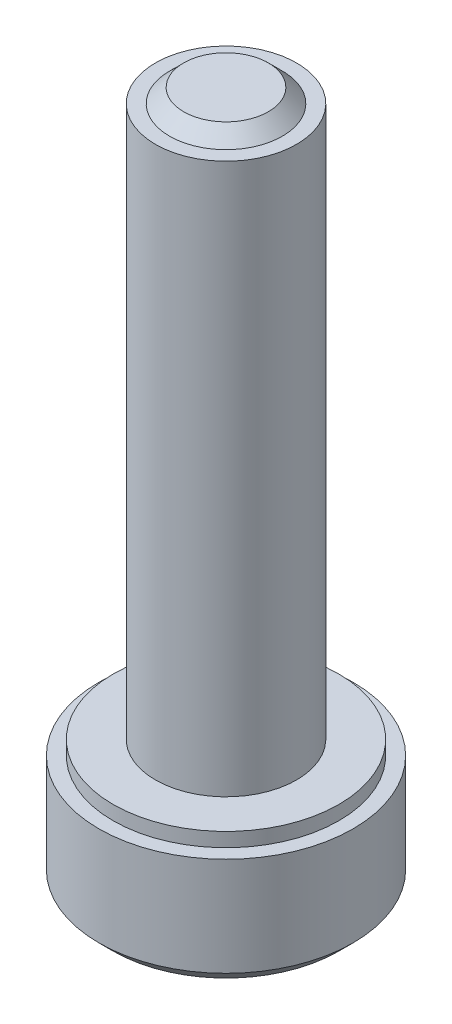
ISO-10303-21;
HEADER;
FILE_DESCRIPTION(('STEP AP214'),'2;1');
FILE_NAME('part.step','',(''),(''),'','','');
FILE_SCHEMA(('AUTOMOTIVE_DESIGN { 1 0 10303 214 1 1 1 1 }'));
ENDSEC;
DATA;
#1=APPLICATION_CONTEXT('core data for automotive mechanical design processes');
#2=APPLICATION_PROTOCOL_DEFINITION('international standard','automotive_design',2000,#1);
#3=PRODUCT_CONTEXT('',#1,'mechanical');
#4=PRODUCT('Part','Part','',(#3));
#5=PRODUCT_RELATED_PRODUCT_CATEGORY('part','',(#4));
#6=PRODUCT_DEFINITION_FORMATION('','',#4);
#7=PRODUCT_DEFINITION_CONTEXT('part definition',#1,'design');
#8=PRODUCT_DEFINITION('design','',#6,#7);
#9=PRODUCT_DEFINITION_SHAPE('','',#8);
#10=(LENGTH_UNIT() NAMED_UNIT(*) SI_UNIT(.MILLI.,.METRE.));
#11=(NAMED_UNIT(*) PLANE_ANGLE_UNIT() SI_UNIT($,.RADIAN.));
#12=(NAMED_UNIT(*) SI_UNIT($,.STERADIAN.) SOLID_ANGLE_UNIT());
#13=UNCERTAINTY_MEASURE_WITH_UNIT(LENGTH_MEASURE(1.E-05),#10,'distance_accuracy_value','');
#14=(GEOMETRIC_REPRESENTATION_CONTEXT(3) GLOBAL_UNCERTAINTY_ASSIGNED_CONTEXT((#13)) GLOBAL_UNIT_ASSIGNED_CONTEXT((#10,
#11,#12)) REPRESENTATION_CONTEXT('',''));
#15=CARTESIAN_POINT('',(0.,0.,0.));
#16=DIRECTION('',(0.,0.,1.));
#17=DIRECTION('',(1.,0.,0.));
#18=AXIS2_PLACEMENT_3D('',#15,#16,#17);
#19=CARTESIAN_POINT('',(0.,8.,0.));
#20=DIRECTION('',(0.,-1.,0.));
#21=DIRECTION('',(0.,0.,-1.));
#22=AXIS2_PLACEMENT_3D('',#19,#20,#21);
#23=CYLINDRICAL_SURFACE('',#22,9.);
#24=CARTESIAN_POINT('',(0.,1.,0.));
#25=DIRECTION('',(0.,1.,0.));
#26=DIRECTION('',(0.,0.,1.));
#27=AXIS2_PLACEMENT_3D('',#24,#25,#26);
#28=CIRCLE('',#27,9.);
#29=CARTESIAN_POINT('',(0.,1.,9.));
#30=VERTEX_POINT('',#29);
#31=EDGE_CURVE('E50',#30,#30,#28,.T.);
#32=ORIENTED_EDGE('',*,*,#31,.T.);
#33=EDGE_LOOP('',(#32));
#34=FACE_BOUND('',#33,.T.);
#35=CARTESIAN_POINT('',(0.,8.,0.));
#36=DIRECTION('',(0.,1.,0.));
#37=DIRECTION('',(0.,0.,1.));
#38=AXIS2_PLACEMENT_3D('',#35,#36,#37);
#39=CIRCLE('',#38,9.);
#40=CARTESIAN_POINT('',(0.,8.,9.));
#41=VERTEX_POINT('',#40);
#42=EDGE_CURVE('E61',#41,#41,#39,.T.);
#43=ORIENTED_EDGE('',*,*,#42,.F.);
#44=EDGE_LOOP('',(#43));
#45=FACE_BOUND('',#44,.T.);
#46=ADVANCED_FACE('F42',(#34,#45),#23,.T.);
#47=CARTESIAN_POINT('',(0.,8.,0.));
#48=DIRECTION('',(0.,1.,0.));
#49=DIRECTION('',(0.,0.,1.));
#50=AXIS2_PLACEMENT_3D('',#47,#48,#49);
#51=PLANE('',#50);
#52=CARTESIAN_POINT('',(0.,8.,0.));
#53=DIRECTION('',(0.,1.,0.));
#54=DIRECTION('',(0.,0.,1.));
#55=AXIS2_PLACEMENT_3D('',#52,#53,#54);
#56=CIRCLE('',#55,8.);
#57=CARTESIAN_POINT('',(0.,8.,8.));
#58=VERTEX_POINT('',#57);
#59=EDGE_CURVE('E64',#58,#58,#56,.T.);
#60=ORIENTED_EDGE('',*,*,#59,.F.);
#61=EDGE_LOOP('',(#60));
#62=FACE_BOUND('',#61,.T.);
#63=ORIENTED_EDGE('',*,*,#42,.T.);
#64=EDGE_LOOP('',(#63));
#65=FACE_BOUND('',#64,.T.);
#66=ADVANCED_FACE('F108',(#62,#65),#51,.T.);
#67=CARTESIAN_POINT('',(0.,0.,0.));
#68=DIRECTION('',(0.,1.,0.));
#69=DIRECTION('',(0.,0.,1.));
#70=AXIS2_PLACEMENT_3D('',#67,#68,#69);
#71=PLANE('',#70);
#72=CARTESIAN_POINT('',(0.,0.,0.));
#73=DIRECTION('',(0.,1.,0.));
#74=DIRECTION('',(0.,0.,1.));
#75=AXIS2_PLACEMENT_3D('',#72,#73,#74);
#76=CIRCLE('',#75,8.);
#77=CARTESIAN_POINT('',(0.,0.,8.));
#78=VERTEX_POINT('',#77);
#79=EDGE_CURVE('E10',#78,#78,#76,.F.);
#80=ORIENTED_EDGE('',*,*,#79,.T.);
#81=EDGE_LOOP('',(#80));
#82=FACE_BOUND('',#81,.T.);
#83=ADVANCED_FACE('F104',(#82),#71,.F.);
#84=CARTESIAN_POINT('',(0.,9.,0.));
#85=DIRECTION('',(0.,-1.,0.));
#86=DIRECTION('',(0.,0.,-1.));
#87=AXIS2_PLACEMENT_3D('',#84,#85,#86);
#88=CYLINDRICAL_SURFACE('',#87,8.);
#89=CARTESIAN_POINT('',(0.,9.,0.));
#90=DIRECTION('',(0.,1.,0.));
#91=DIRECTION('',(0.,0.,1.));
#92=AXIS2_PLACEMENT_3D('',#89,#90,#91);
#93=CIRCLE('',#92,8.);
#94=CARTESIAN_POINT('',(0.,9.,8.));
#95=VERTEX_POINT('',#94);
#96=EDGE_CURVE('E65',#95,#95,#93,.T.);
#97=ORIENTED_EDGE('',*,*,#96,.F.);
#98=EDGE_LOOP('',(#97));
#99=FACE_BOUND('',#98,.T.);
#100=ORIENTED_EDGE('',*,*,#59,.T.);
#101=EDGE_LOOP('',(#100));
#102=FACE_BOUND('',#101,.T.);
#103=ADVANCED_FACE('F98',(#99,#102),#88,.T.);
#104=CARTESIAN_POINT('',(0.,9.,0.));
#105=DIRECTION('',(0.,1.,0.));
#106=DIRECTION('',(0.,0.,1.));
#107=AXIS2_PLACEMENT_3D('',#104,#105,#106);
#108=PLANE('',#107);
#109=CARTESIAN_POINT('',(0.,9.,0.));
#110=DIRECTION('',(0.,1.,0.));
#111=DIRECTION('',(0.,0.,1.));
#112=AXIS2_PLACEMENT_3D('',#109,#110,#111);
#113=CIRCLE('',#112,5.);
#114=CARTESIAN_POINT('',(0.,9.,5.));
#115=VERTEX_POINT('',#114);
#116=EDGE_CURVE('E68',#115,#115,#113,.T.);
#117=ORIENTED_EDGE('',*,*,#116,.F.);
#118=EDGE_LOOP('',(#117));
#119=FACE_BOUND('',#118,.T.);
#120=ORIENTED_EDGE('',*,*,#96,.T.);
#121=EDGE_LOOP('',(#120));
#122=FACE_BOUND('',#121,.T.);
#123=ADVANCED_FACE('F92',(#119,#122),#108,.T.);
#124=CARTESIAN_POINT('',(0.,48.,0.));
#125=DIRECTION('',(0.,-1.,0.));
#126=DIRECTION('',(0.,0.,-1.));
#127=AXIS2_PLACEMENT_3D('',#124,#125,#126);
#128=CYLINDRICAL_SURFACE('',#127,5.);
#129=CARTESIAN_POINT('',(0.,48.,0.));
#130=DIRECTION('',(0.,1.,0.));
#131=DIRECTION('',(0.,0.,1.));
#132=AXIS2_PLACEMENT_3D('',#129,#130,#131);
#133=CIRCLE('',#132,5.);
#134=CARTESIAN_POINT('',(0.,48.,5.));
#135=VERTEX_POINT('',#134);
#136=EDGE_CURVE('E71',#135,#135,#133,.T.);
#137=ORIENTED_EDGE('',*,*,#136,.F.);
#138=EDGE_LOOP('',(#137));
#139=FACE_BOUND('',#138,.T.);
#140=ORIENTED_EDGE('',*,*,#116,.T.);
#141=EDGE_LOOP('',(#140));
#142=FACE_BOUND('',#141,.T.);
#143=ADVANCED_FACE('F86',(#139,#142),#128,.T.);
#144=CARTESIAN_POINT('',(0.,48.,0.));
#145=DIRECTION('',(0.,1.,0.));
#146=DIRECTION('',(0.,0.,1.));
#147=AXIS2_PLACEMENT_3D('',#144,#145,#146);
#148=PLANE('',#147);
#149=CARTESIAN_POINT('',(0.,48.,0.));
#150=DIRECTION('',(0.,1.,0.));
#151=DIRECTION('',(0.,0.,1.));
#152=AXIS2_PLACEMENT_3D('',#149,#150,#151);
#153=CIRCLE('',#152,4.);
#154=CARTESIAN_POINT('',(0.,48.,4.));
#155=VERTEX_POINT('',#154);
#156=EDGE_CURVE('E58',#155,#155,#153,.T.);
#157=ORIENTED_EDGE('',*,*,#156,.F.);
#158=EDGE_LOOP('',(#157));
#159=FACE_BOUND('',#158,.T.);
#160=ORIENTED_EDGE('',*,*,#136,.T.);
#161=EDGE_LOOP('',(#160));
#162=FACE_BOUND('',#161,.T.);
#163=ADVANCED_FACE('F82',(#159,#162),#148,.T.);
#164=CARTESIAN_POINT('',(0.,49.,0.));
#165=DIRECTION('',(0.,1.,0.));
#166=DIRECTION('',(0.,0.,1.));
#167=AXIS2_PLACEMENT_3D('',#164,#165,#166);
#168=PLANE('',#167);
#169=CARTESIAN_POINT('',(0.,49.,0.));
#170=DIRECTION('',(0.,1.,0.));
#171=DIRECTION('',(0.,0.,1.));
#172=AXIS2_PLACEMENT_3D('',#169,#170,#171);
#173=CIRCLE('',#172,3.);
#174=CARTESIAN_POINT('',(0.,49.,3.));
#175=VERTEX_POINT('',#174);
#176=EDGE_CURVE('E54',#175,#175,#173,.T.);
#177=ORIENTED_EDGE('',*,*,#176,.T.);
#178=EDGE_LOOP('',(#177));
#179=FACE_BOUND('',#178,.T.);
#180=ADVANCED_FACE('F85',(#179),#168,.T.);
#181=CARTESIAN_POINT('',(0.,49.,0.));
#182=DIRECTION('',(0.,-1.,0.));
#183=DIRECTION('',(0.,0.,-1.));
#184=AXIS2_PLACEMENT_3D('',#181,#182,#183);
#185=CONICAL_SURFACE('',#184,3.,0.785398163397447);
#186=ORIENTED_EDGE('',*,*,#156,.T.);
#187=EDGE_LOOP('',(#186));
#188=FACE_BOUND('',#187,.T.);
#189=ORIENTED_EDGE('',*,*,#176,.F.);
#190=EDGE_LOOP('',(#189));
#191=FACE_BOUND('',#190,.T.);
#192=ADVANCED_FACE('F79',(#188,#191),#185,.T.);
#193=CARTESIAN_POINT('',(0.,1.,0.));
#194=DIRECTION('',(0.,1.,0.));
#195=DIRECTION('',(0.,0.,1.));
#196=AXIS2_PLACEMENT_3D('',#193,#194,#195);
#197=CONICAL_SURFACE('',#196,9.,0.785398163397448);
#198=ORIENTED_EDGE('',*,*,#79,.F.);
#199=EDGE_LOOP('',(#198));
#200=FACE_BOUND('',#199,.T.);
#201=ORIENTED_EDGE('',*,*,#31,.F.);
#202=EDGE_LOOP('',(#201));
#203=FACE_BOUND('',#202,.T.);
#204=ADVANCED_FACE('F45',(#200,#203),#197,.T.);
#205=CLOSED_SHELL('',(#46,#66,#83,#103,#123,#143,#163,#180,#192,#204));
#206=MANIFOLD_SOLID_BREP('B2',#205);
#207=ADVANCED_BREP_SHAPE_REPRESENTATION('',(#18,#206),#14);
#208=SHAPE_DEFINITION_REPRESENTATION(#9,#207);
ENDSEC;
END-ISO-10303-21;
